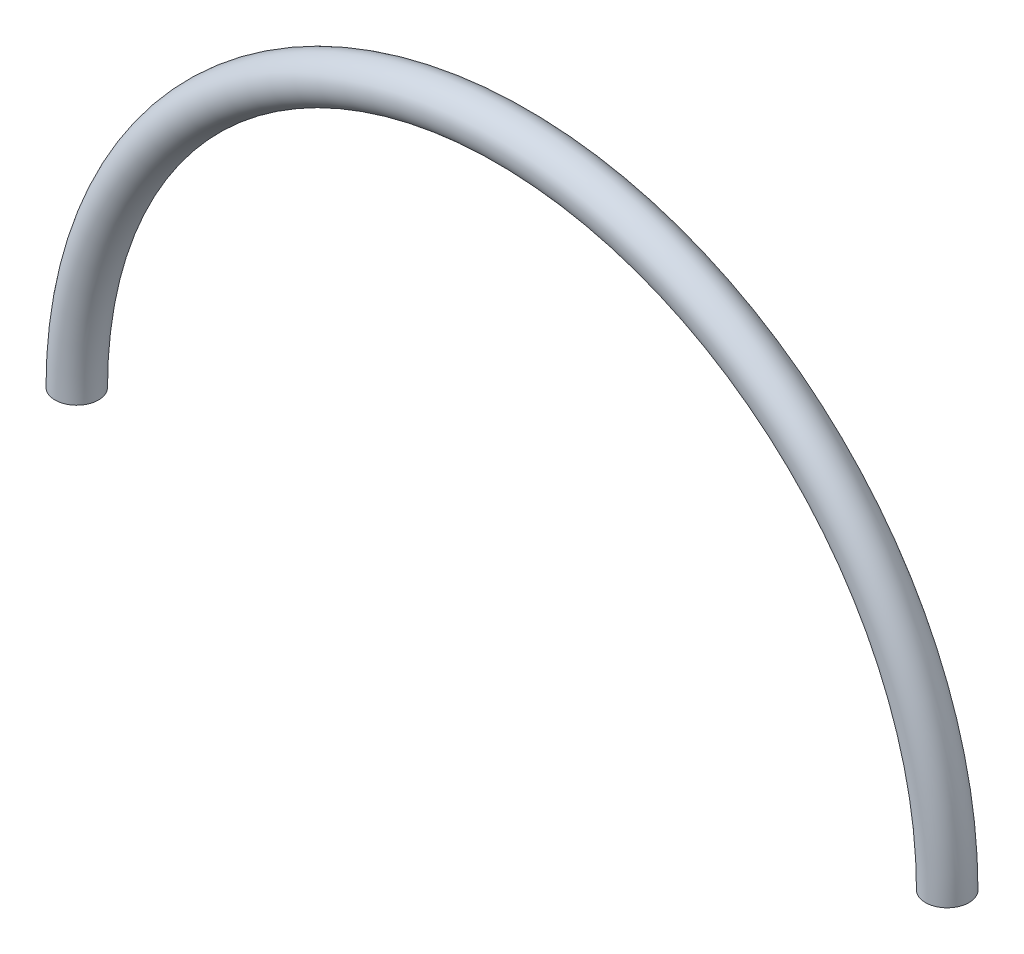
ISO-10303-21;
HEADER;
FILE_DESCRIPTION(('STEP AP214'),'2;1');
FILE_NAME('part.step','',(''),(''),'','','');
FILE_SCHEMA(('AUTOMOTIVE_DESIGN { 1 0 10303 214 1 1 1 1 }'));
ENDSEC;
DATA;
#1=APPLICATION_CONTEXT('core data for automotive mechanical design processes');
#2=APPLICATION_PROTOCOL_DEFINITION('international standard','automotive_design',2000,#1);
#3=PRODUCT_CONTEXT('',#1,'mechanical');
#4=PRODUCT('Part','Part','',(#3));
#5=PRODUCT_RELATED_PRODUCT_CATEGORY('part','',(#4));
#6=PRODUCT_DEFINITION_FORMATION('','',#4);
#7=PRODUCT_DEFINITION_CONTEXT('part definition',#1,'design');
#8=PRODUCT_DEFINITION('design','',#6,#7);
#9=PRODUCT_DEFINITION_SHAPE('','',#8);
#10=(LENGTH_UNIT() NAMED_UNIT(*) SI_UNIT(.MILLI.,.METRE.));
#11=(NAMED_UNIT(*) PLANE_ANGLE_UNIT() SI_UNIT($,.RADIAN.));
#12=(NAMED_UNIT(*) SI_UNIT($,.STERADIAN.) SOLID_ANGLE_UNIT());
#13=UNCERTAINTY_MEASURE_WITH_UNIT(LENGTH_MEASURE(1.E-05),#10,'distance_accuracy_value','');
#14=(GEOMETRIC_REPRESENTATION_CONTEXT(3) GLOBAL_UNCERTAINTY_ASSIGNED_CONTEXT((#13)) GLOBAL_UNIT_ASSIGNED_CONTEXT((#10,
#11,#12)) REPRESENTATION_CONTEXT('',''));
#15=CARTESIAN_POINT('',(0.,0.,0.));
#16=DIRECTION('',(0.,0.,1.));
#17=DIRECTION('',(1.,0.,0.));
#18=AXIS2_PLACEMENT_3D('',#15,#16,#17);
#19=CARTESIAN_POINT('',(0.,0.,0.));
#20=DIRECTION('',(0.,0.,-1.));
#21=DIRECTION('',(-1.,0.,0.));
#22=AXIS2_PLACEMENT_3D('',#19,#20,#21);
#23=TOROIDAL_SURFACE('',#22,10.,0.499999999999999);
#24=CARTESIAN_POINT('',(-10.,0.,0.));
#25=DIRECTION('',(0.,-1.,0.));
#26=DIRECTION('',(0.,0.,1.));
#27=AXIS2_PLACEMENT_3D('',#24,#25,#26);
#28=CIRCLE('',#27,0.499999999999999);
#29=CARTESIAN_POINT('',(-10.5,0.,0.));
#30=VERTEX_POINT('',#29);
#31=EDGE_CURVE('E10',#30,#30,#28,.T.);
#32=CARTESIAN_POINT('',(10.,0.,0.));
#33=DIRECTION('',(0.,1.,0.));
#34=DIRECTION('',(0.,0.,1.));
#35=AXIS2_PLACEMENT_3D('',#32,#33,#34);
#36=CIRCLE('',#35,0.499999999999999);
#37=CARTESIAN_POINT('',(10.5,0.,0.));
#38=VERTEX_POINT('',#37);
#39=EDGE_CURVE('E33',#38,#38,#36,.T.);
#40=CARTESIAN_POINT('',(0.,0.,0.));
#41=DIRECTION('',(0.,0.,-1.));
#42=DIRECTION('',(-1.,0.,0.));
#43=AXIS2_PLACEMENT_3D('',#40,#41,#42);
#44=CIRCLE('',#43,10.5);
#45=EDGE_CURVE('',#30,#38,#44,.T.);
#46=ORIENTED_EDGE('',*,*,#31,.F.);
#47=ORIENTED_EDGE('',*,*,#39,.T.);
#48=ORIENTED_EDGE('',*,*,#45,.T.);
#49=ORIENTED_EDGE('',*,*,#45,.F.);
#50=EDGE_LOOP('',(#46,#48,#47,#49));
#51=FACE_BOUND('',#50,.T.);
#52=ADVANCED_FACE('F27',(#51),#23,.T.);
#53=CARTESIAN_POINT('',(-10.,0.,0.));
#54=DIRECTION('',(0.,-1.,0.));
#55=DIRECTION('',(0.,0.,1.));
#56=AXIS2_PLACEMENT_3D('',#53,#54,#55);
#57=PLANE('',#56);
#58=ORIENTED_EDGE('',*,*,#31,.T.);
#59=EDGE_LOOP('',(#58));
#60=FACE_BOUND('',#59,.T.);
#61=ADVANCED_FACE('F42',(#60),#57,.T.);
#62=CARTESIAN_POINT('',(10.,0.,0.));
#63=DIRECTION('',(0.,1.,0.));
#64=DIRECTION('',(0.,0.,1.));
#65=AXIS2_PLACEMENT_3D('',#62,#63,#64);
#66=PLANE('',#65);
#67=ORIENTED_EDGE('',*,*,#39,.F.);
#68=EDGE_LOOP('',(#67));
#69=FACE_BOUND('',#68,.T.);
#70=ADVANCED_FACE('F40',(#69),#66,.F.);
#71=CLOSED_SHELL('',(#52,#61,#70));
#72=MANIFOLD_SOLID_BREP('B2',#71);
#73=ADVANCED_BREP_SHAPE_REPRESENTATION('',(#18,#72),#14);
#74=SHAPE_DEFINITION_REPRESENTATION(#9,#73);
ENDSEC;
END-ISO-10303-21;
